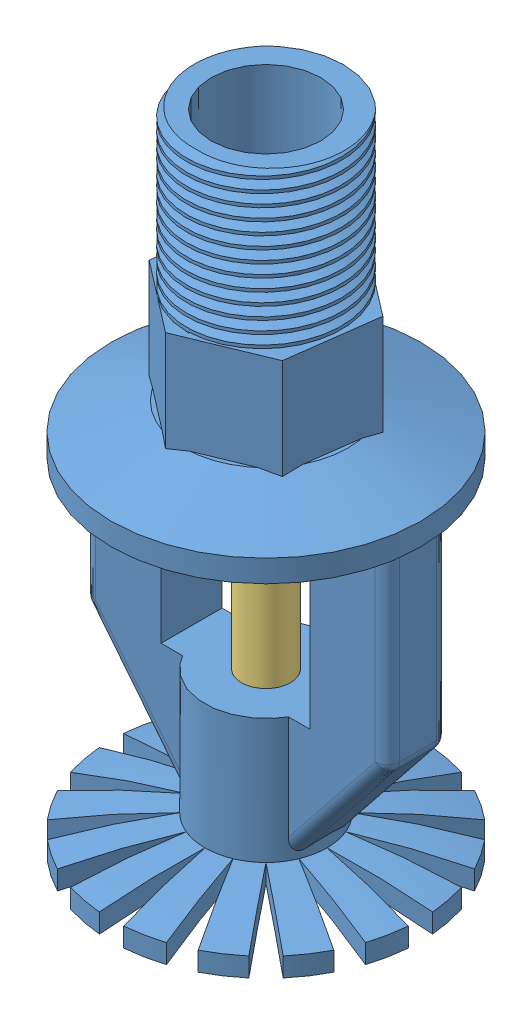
SolidWorks assembly Sprinkler - Aspersor.SLDASM, configuration Default (file format 11000). Lengths in mm.
Overall size (25.4 53.15 25.4).
3 component instances, 3 part files, 5 mates.
Components (placement in the parent):
- Sprinkler-1: Sprinkler.SLDPRT [Default] at (18.1164 37.3176 44.3194) size (25.4 53.15 25.4)
- top-1: top.SLDPRT [Default] at (18.1164 25.8537 44.3194) x (0 -1 0) z (0 0 1) size (2 10.37 10.37)
- Liquid-1: Liquid.SLDPRT [Default] at (18.1164 17.0837 44.3194) x (0.788396 0 -0.615168) z (0.615168 0 0.788396) size (4 17.04 4)
Mates (geometry in assembly coordinates):
- Coincident1: coincident: circle of assembly; cone of assembly; circle of Sprinkler-1; cone of top-1 through (18.1164 25.8537 44.3194) axis (0 1 0)
- Concentric1: concentric: circle of assembly; circle of assembly; circle of Sprinkler-1; circle of top-1
- Parallel1: parallel: plane of assembly; plane of assembly; plane of Sprinkler-1 through (18.1164 25.3176 44.3194) normal (0 -1 0); plane of top-1 through (18.1164 23.8537 44.3194) normal (0 -1 0)
- Concentric2: concentric: sphere of assembly; sphere of assembly; sphere of top-1; sphere of Liquid-1
- Concentric3: concentric: circle of assembly; circle of assembly; circle of top-1; circle of Liquid-1
